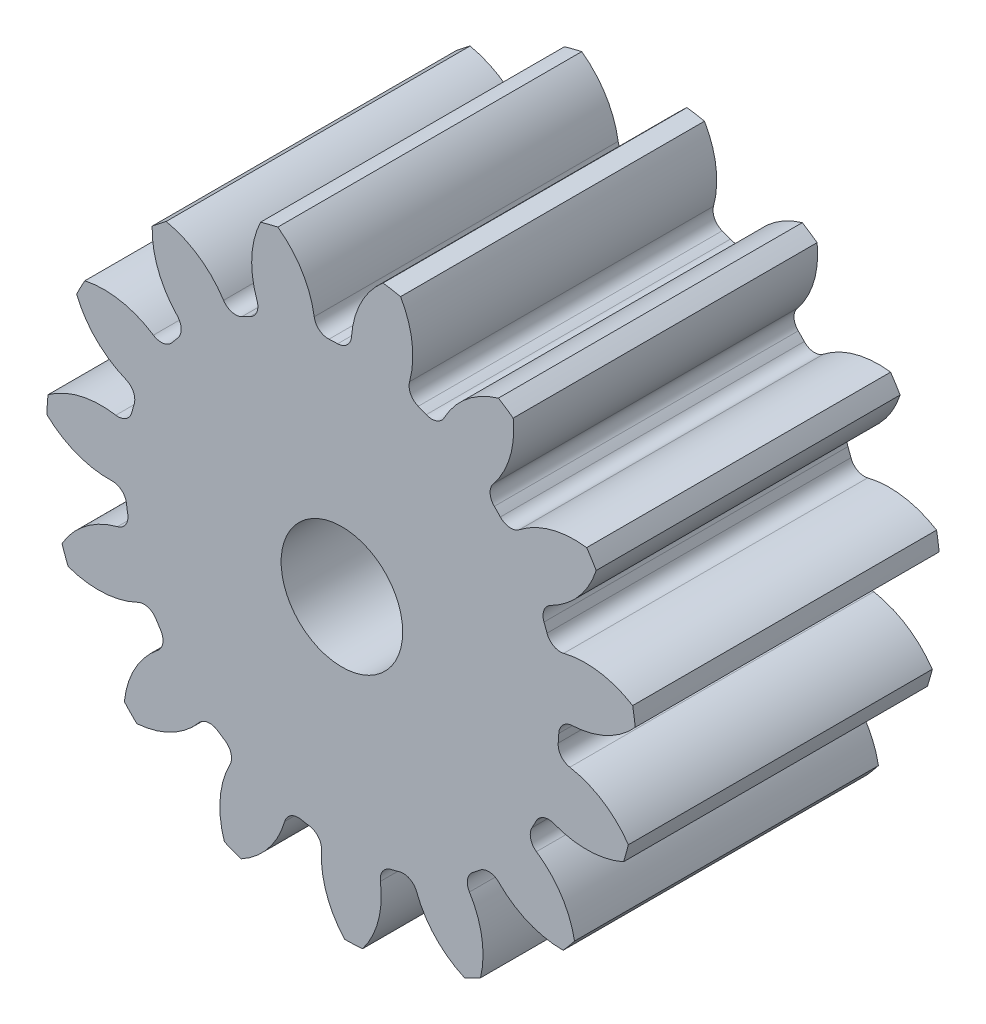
from build123d import *

# Parameters (mm, degrees)
SKETCH3_R         = 86.36
GEARBODY_DEPTH    = 88.9
TOOTHCUT_DEPTH    = 152.060614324
CIRPATTERN1_COUNT = 15
BOREDIA_R         = 17.78
BORE_DEPTH        = 12700


with BuildPart() as part:
    # Sketch3 → gearBody (new body)
    with BuildSketch(Plane.XY):
        Circle(SKETCH3_R)
    extrude(amount=GEARBODY_DEPTH)

    # Sketch2 → toothCut (cut, through all)
    with BuildSketch(Plane.XY):
        with BuildLine():
            ThreePointArc((63.269895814, -5.400952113), (63.365125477, -4.136529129), (63.435088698, -2.87045673))
            ThreePointArc((63.435088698, -2.87045673), (64.640397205, -0.135023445), (67.374498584, 1.07330329))
            ThreePointArc((67.374498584, 1.07330329), (77.85391741, 3.784183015), (86.36, 10.47848259))
            ThreePointArc((86.36, 10.47848259), (86.808605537, -5.666939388), (84.264778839, -21.617012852))
            ThreePointArc((84.264778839, -21.617012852), (76.70119766, -13.873671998), (66.663152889, -9.82339485))
            ThreePointArc((66.663152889, -9.82339485), (64.109347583, -8.269869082), (63.269895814, -5.400952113))
        make_face()
    toothcut = extrude(amount=TOOTHCUT_DEPTH, mode=Mode.SUBTRACT)

    # CirPattern1: toothCut ×15 about axis
    cirpattern1_axis = Axis((0, 0, 0), (0, 0, 1))
    for i in range(1, CIRPATTERN1_COUNT):
        add(toothcut.rotate(cirpattern1_axis, i * 360 / CIRPATTERN1_COUNT), mode=Mode.SUBTRACT)

    # boreDia → bore (cut, symmetric)
    with BuildSketch(Plane.XY):
        Circle(BOREDIA_R)
    extrude(amount=BORE_DEPTH, both=True, mode=Mode.SUBTRACT)


solid = part.part
